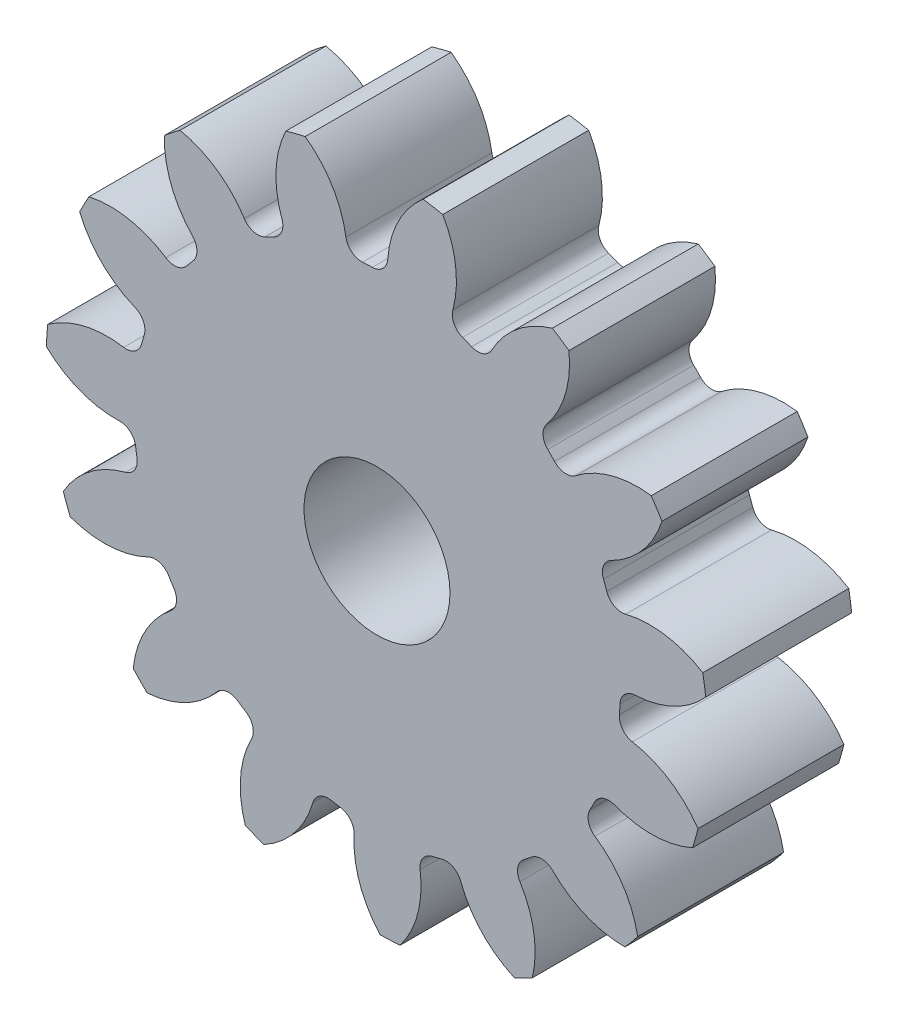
from build123d import *

# Parameters (mm, degrees)
SKETCH3_R         = 287.866666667
GEARBODY_DEPTH    = 127
TOOTHCUT_DEPTH    = 427.45449412
CIRPATTERN1_COUNT = 15
BOREDIA_R         = 63.5
BORE_DEPTH        = 12700


with BuildPart() as part:
    # Sketch3 → gearBody (new body)
    with BuildSketch(Plane.XY):
        Circle(SKETCH3_R)
    extrude(amount=GEARBODY_DEPTH)

    # Sketch2 → toothCut (cut, through all)
    with BuildSketch(Plane.XY):
        with BuildLine():
            ThreePointArc((210.899652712, -18.003173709), (211.217084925, -13.788430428), (211.450295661, -9.568189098))
            ThreePointArc((211.450295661, -9.568189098), (215.467990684, -0.450078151), (224.581661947, 3.577677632))
            ThreePointArc((224.581661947, 3.577677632), (259.513058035, 12.613943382), (287.866666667, 34.928275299))
            ThreePointArc((287.866666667, 34.928275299), (289.362018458, -18.889797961), (280.882596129, -72.056709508))
            ThreePointArc((280.882596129, -72.056709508), (255.670658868, -46.245573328), (222.210509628, -32.744649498))
            ThreePointArc((222.210509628, -32.744649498), (213.697825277, -27.566230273), (210.899652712, -18.003173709))
        make_face()
    toothcut = extrude(amount=TOOTHCUT_DEPTH, mode=Mode.SUBTRACT)

    # CirPattern1: toothCut ×15 about axis
    cirpattern1_axis = Axis((0, 0, 0), (0, 0, 1))
    for i in range(1, CIRPATTERN1_COUNT):
        add(toothcut.rotate(cirpattern1_axis, i * 360 / CIRPATTERN1_COUNT), mode=Mode.SUBTRACT)

    # boreDia → bore (cut, symmetric)
    with BuildSketch(Plane.XY):
        Circle(BOREDIA_R)
    extrude(amount=BORE_DEPTH, both=True, mode=Mode.SUBTRACT)


solid = part.part
